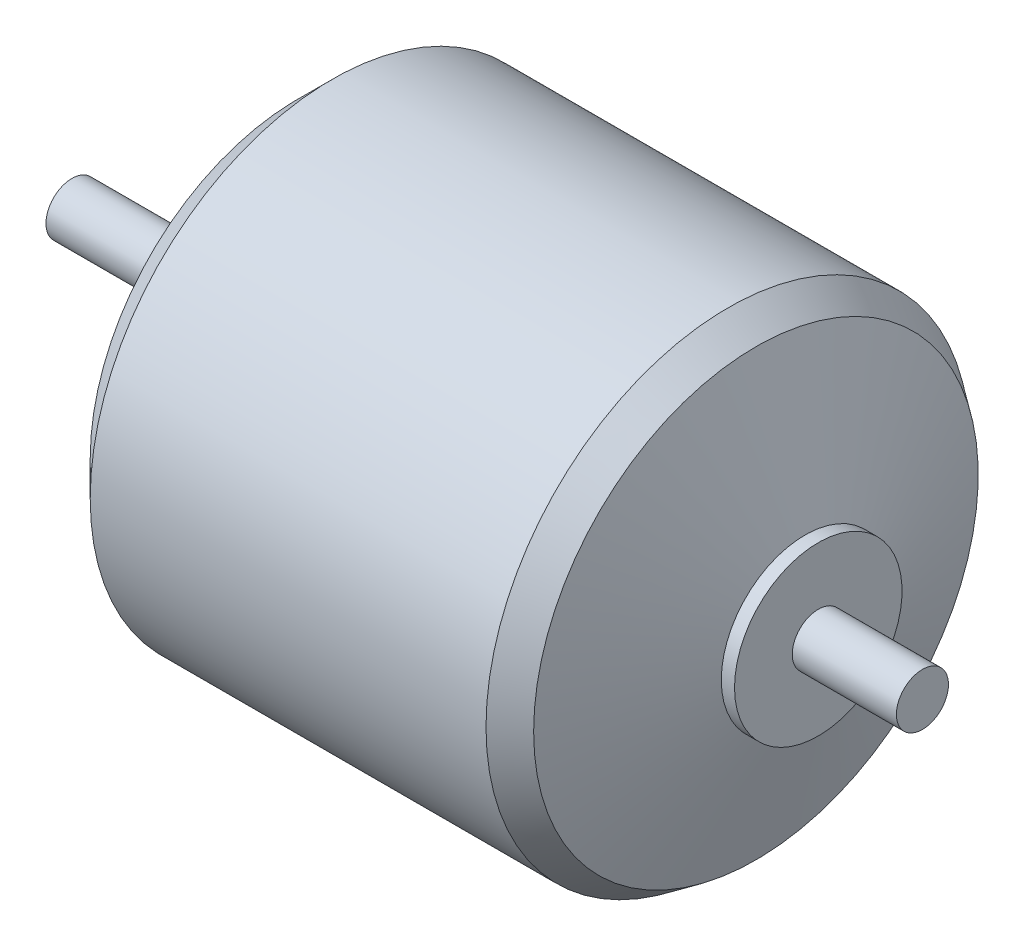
from build123d import *

# Parameters (mm, degrees)
SKETCH1_R           = 13.95
BOSS_EXTRUDE1_DEPTH = 30
SKETCH2_R           = 1.5
BOSS_EXTRUDE2_DEPTH = 6
BOSS_EXTRUDE3_START = 13
SKETCH3_R           = 1.5
BOSS_EXTRUDE3_DEPTH = 13
SKETCH4_R           = 1.5
CUT_EXTRUDE1_DEPTH  = 4
SKETCH7_R           = 3.5
BOSS_EXTRUDE4_DEPTH = 4


with BuildPart() as part:
    # Sketch1 → Boss-Extrude1 (new body)
    with BuildSketch(Plane(origin=(0, 0, 0), x_dir=(0, 0, -1), z_dir=(1, 0, 0))):
        Circle(SKETCH1_R)
    extrude(amount=BOSS_EXTRUDE1_DEPTH)

    # Sketch2 → Boss-Extrude2 (add)
    with BuildSketch(Plane(origin=(30, 0, 0), x_dir=(0, 0, -1), z_dir=(1, 0, 0))):
        Circle(SKETCH2_R)
    extrude(amount=BOSS_EXTRUDE2_DEPTH)

    # Sketch3 → Boss-Extrude3 (add)
    with BuildSketch(Plane.ZY.offset(BOSS_EXTRUDE3_START)):
        with Locations(Location((0, 0, 0), (0, 0, 180))):
            Circle(SKETCH3_R)
    extrude(amount=-BOSS_EXTRUDE3_DEPTH)

    # Sketch4 → Cut-Extrude1 (cut)
    with BuildSketch(Plane.ZY):
        with Locations((-9.5, 0)):
            Circle(SKETCH4_R)
        with Locations((9.5, 0)):
            Circle(SKETCH4_R)
        with Locations((0, 9.5)):
            Circle(SKETCH4_R)
        with Locations((0, -9.5)):
            Circle(SKETCH4_R)
    extrude(amount=-CUT_EXTRUDE1_DEPTH, mode=Mode.SUBTRACT)

    # Sketch5 → Cut-Revolve1 (revolve, cut)
    with BuildSketch(Plane.XY, mode=Mode.PRIVATE) as cut_revolve1_sk:
        Polygon((0, 11.95), (2, 13.95), (0, 13.95), align=None)
        Polygon((30, 4.82643937), (29.238118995, 4.82643937), (26.407070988, 12.807948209), (24.803947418, 13.95), (30, 13.95), align=None)
    revolve(cut_revolve1_sk.sketch.rotate(Axis((-14.254748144, 0, 0), (1, 0, 0)), 90), axis=Axis((-14.254748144, 0, 0), (1, 0, 0)), mode=Mode.SUBTRACT)

    # Sketch7 → Boss-Extrude4 (add)
    with BuildSketch(Plane.ZY):
        with Locations(Location((0, 0, 0), (0, 0, 180))):
            Circle(SKETCH7_R)
    extrude(amount=BOSS_EXTRUDE4_DEPTH)


solid = part.part
